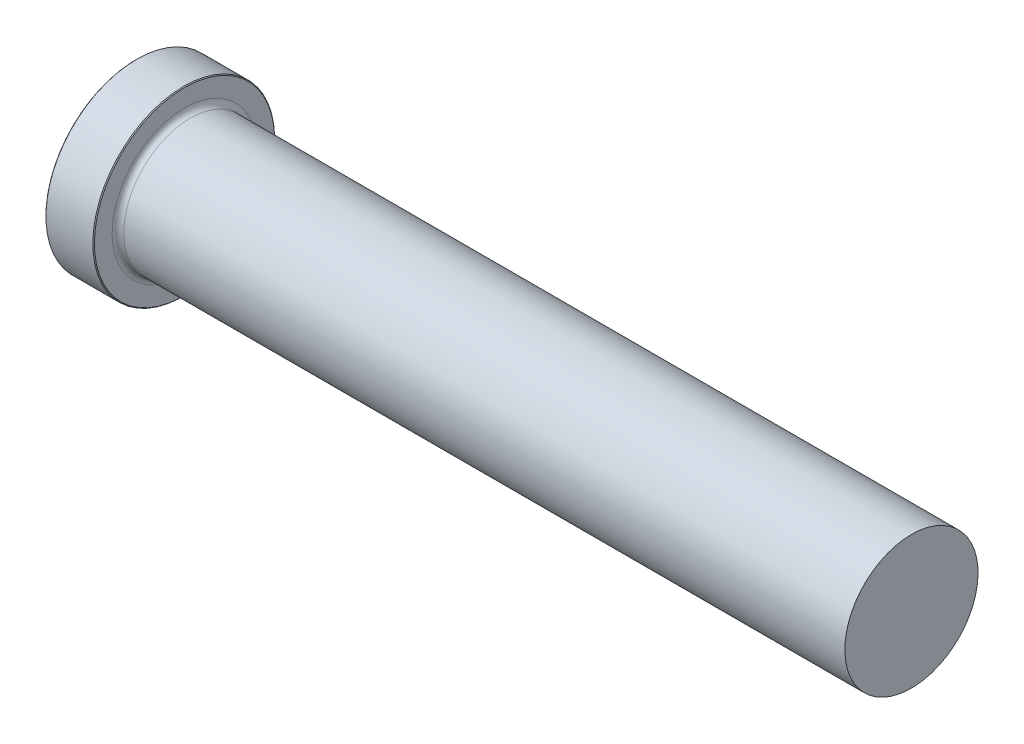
ISO-10303-21;
HEADER;
FILE_DESCRIPTION(('STEP AP214'),'2;1');
FILE_NAME('part.step','',(''),(''),'','','');
FILE_SCHEMA(('AUTOMOTIVE_DESIGN { 1 0 10303 214 1 1 1 1 }'));
ENDSEC;
DATA;
#1=APPLICATION_CONTEXT('core data for automotive mechanical design processes');
#2=APPLICATION_PROTOCOL_DEFINITION('international standard','automotive_design',2000,#1);
#3=PRODUCT_CONTEXT('',#1,'mechanical');
#4=PRODUCT('Part','Part','',(#3));
#5=PRODUCT_RELATED_PRODUCT_CATEGORY('part','',(#4));
#6=PRODUCT_DEFINITION_FORMATION('','',#4);
#7=PRODUCT_DEFINITION_CONTEXT('part definition',#1,'design');
#8=PRODUCT_DEFINITION('design','',#6,#7);
#9=PRODUCT_DEFINITION_SHAPE('','',#8);
#10=(LENGTH_UNIT() NAMED_UNIT(*) SI_UNIT(.MILLI.,.METRE.));
#11=(NAMED_UNIT(*) PLANE_ANGLE_UNIT() SI_UNIT($,.RADIAN.));
#12=(NAMED_UNIT(*) SI_UNIT($,.STERADIAN.) SOLID_ANGLE_UNIT());
#13=UNCERTAINTY_MEASURE_WITH_UNIT(LENGTH_MEASURE(1.E-05),#10,'distance_accuracy_value','');
#14=(GEOMETRIC_REPRESENTATION_CONTEXT(3) GLOBAL_UNCERTAINTY_ASSIGNED_CONTEXT((#13)) GLOBAL_UNIT_ASSIGNED_CONTEXT((#10,
#11,#12)) REPRESENTATION_CONTEXT('',''));
#15=CARTESIAN_POINT('',(0.,0.,0.));
#16=DIRECTION('',(0.,0.,1.));
#17=DIRECTION('',(1.,0.,0.));
#18=AXIS2_PLACEMENT_3D('',#15,#16,#17);
#19=CARTESIAN_POINT('',(101.6,8.7249,0.));
#20=DIRECTION('',(1.,0.,0.));
#21=DIRECTION('',(0.,1.,0.));
#22=AXIS2_PLACEMENT_3D('',#19,#20,#21);
#23=PLANE('',#22);
#24=CARTESIAN_POINT('',(101.6,0.,0.));
#25=DIRECTION('',(1.,0.,0.));
#26=DIRECTION('',(0.,1.,0.));
#27=AXIS2_PLACEMENT_3D('',#24,#25,#26);
#28=CIRCLE('',#27,8.7249);
#29=CARTESIAN_POINT('',(101.6,8.7249,0.));
#30=VERTEX_POINT('',#29);
#31=EDGE_CURVE('E50',#30,#30,#28,.T.);
#32=ORIENTED_EDGE('',*,*,#31,.T.);
#33=EDGE_LOOP('',(#32));
#34=FACE_BOUND('',#33,.T.);
#35=ADVANCED_FACE('F30',(#34),#23,.T.);
#36=CARTESIAN_POINT('',(101.6,0.,0.));
#37=DIRECTION('',(1.,0.,0.));
#38=DIRECTION('',(0.,1.,0.));
#39=AXIS2_PLACEMENT_3D('',#36,#37,#38);
#40=CYLINDRICAL_SURFACE('',#39,8.7249);
#41=CARTESIAN_POINT('',(7.11199999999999,0.,0.));
#42=DIRECTION('',(1.,0.,0.));
#43=DIRECTION('',(0.,1.,0.));
#44=AXIS2_PLACEMENT_3D('',#41,#42,#43);
#45=CIRCLE('',#44,8.7249);
#46=CARTESIAN_POINT('',(7.11199999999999,8.7249,0.));
#47=VERTEX_POINT('',#46);
#48=EDGE_CURVE('E53',#47,#47,#45,.T.);
#49=ORIENTED_EDGE('',*,*,#48,.T.);
#50=EDGE_LOOP('',(#49));
#51=FACE_BOUND('',#50,.T.);
#52=ORIENTED_EDGE('',*,*,#31,.F.);
#53=EDGE_LOOP('',(#52));
#54=FACE_BOUND('',#53,.T.);
#55=ADVANCED_FACE('F74',(#51,#54),#40,.T.);
#56=CARTESIAN_POINT('',(7.112,0.,0.));
#57=DIRECTION('',(1.,0.,0.));
#58=DIRECTION('',(0.,1.,0.));
#59=AXIS2_PLACEMENT_3D('',#56,#57,#58);
#60=TOROIDAL_SURFACE('',#59,9.4869,0.762000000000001);
#61=CARTESIAN_POINT('',(6.34999999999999,0.,0.));
#62=DIRECTION('',(1.,0.,0.));
#63=DIRECTION('',(0.,1.,0.));
#64=AXIS2_PLACEMENT_3D('',#61,#62,#63);
#65=CIRCLE('',#64,9.4869);
#66=CARTESIAN_POINT('',(6.35,9.4869,0.));
#67=VERTEX_POINT('',#66);
#68=EDGE_CURVE('E56',#67,#67,#65,.T.);
#69=ORIENTED_EDGE('',*,*,#68,.T.);
#70=EDGE_LOOP('',(#69));
#71=FACE_BOUND('',#70,.T.);
#72=ORIENTED_EDGE('',*,*,#48,.F.);
#73=EDGE_LOOP('',(#72));
#74=FACE_BOUND('',#73,.T.);
#75=ADVANCED_FACE('F60',(#71,#74),#60,.F.);
#76=CARTESIAN_POINT('',(6.35,11.90625,0.));
#77=DIRECTION('',(1.,0.,0.));
#78=DIRECTION('',(0.,1.,0.));
#79=AXIS2_PLACEMENT_3D('',#76,#77,#78);
#80=PLANE('',#79);
#81=CARTESIAN_POINT('',(6.35,0.,0.));
#82=DIRECTION('',(1.,0.,0.));
#83=DIRECTION('',(0.,1.,0.));
#84=AXIS2_PLACEMENT_3D('',#81,#82,#83);
#85=CIRCLE('',#84,11.80465);
#86=CARTESIAN_POINT('',(6.35,11.80465,0.));
#87=VERTEX_POINT('',#86);
#88=EDGE_CURVE('E10',#87,#87,#85,.T.);
#89=ORIENTED_EDGE('',*,*,#88,.T.);
#90=EDGE_LOOP('',(#89));
#91=FACE_BOUND('',#90,.T.);
#92=ORIENTED_EDGE('',*,*,#68,.F.);
#93=EDGE_LOOP('',(#92));
#94=FACE_BOUND('',#93,.T.);
#95=ADVANCED_FACE('F63',(#91,#94),#80,.T.);
#96=CARTESIAN_POINT('',(101.6,0.,0.));
#97=DIRECTION('',(1.,0.,0.));
#98=DIRECTION('',(0.,1.,0.));
#99=AXIS2_PLACEMENT_3D('',#96,#97,#98);
#100=CYLINDRICAL_SURFACE('',#99,11.90625);
#101=CARTESIAN_POINT('',(0.101600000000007,0.,0.));
#102=DIRECTION('',(-1.,0.,0.));
#103=DIRECTION('',(0.,-1.,0.));
#104=AXIS2_PLACEMENT_3D('',#101,#102,#103);
#105=CIRCLE('',#104,11.90625);
#106=CARTESIAN_POINT('',(0.101600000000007,-11.90625,0.));
#107=VERTEX_POINT('',#106);
#108=EDGE_CURVE('E41',#107,#107,#105,.F.);
#109=ORIENTED_EDGE('',*,*,#108,.T.);
#110=EDGE_LOOP('',(#109));
#111=FACE_BOUND('',#110,.T.);
#112=CARTESIAN_POINT('',(6.2484,0.,0.));
#113=DIRECTION('',(1.,0.,0.));
#114=DIRECTION('',(0.,1.,0.));
#115=AXIS2_PLACEMENT_3D('',#112,#113,#114);
#116=CIRCLE('',#115,11.90625);
#117=CARTESIAN_POINT('',(6.2484,11.90625,0.));
#118=VERTEX_POINT('',#117);
#119=EDGE_CURVE('E45',#118,#118,#116,.F.);
#120=ORIENTED_EDGE('',*,*,#119,.T.);
#121=EDGE_LOOP('',(#120));
#122=FACE_BOUND('',#121,.T.);
#123=ADVANCED_FACE('F65',(#111,#122),#100,.T.);
#124=CARTESIAN_POINT('',(0.,0.,0.));
#125=DIRECTION('',(-1.,0.,0.));
#126=DIRECTION('',(0.,-1.,0.));
#127=AXIS2_PLACEMENT_3D('',#124,#125,#126);
#128=PLANE('',#127);
#129=CARTESIAN_POINT('',(0.,0.,0.));
#130=DIRECTION('',(-1.,0.,0.));
#131=DIRECTION('',(0.,-1.,0.));
#132=AXIS2_PLACEMENT_3D('',#129,#130,#131);
#133=CIRCLE('',#132,11.80465);
#134=CARTESIAN_POINT('',(0.,-11.80465,0.));
#135=VERTEX_POINT('',#134);
#136=EDGE_CURVE('E37',#135,#135,#133,.T.);
#137=ORIENTED_EDGE('',*,*,#136,.T.);
#138=EDGE_LOOP('',(#137));
#139=FACE_BOUND('',#138,.T.);
#140=ADVANCED_FACE('F71',(#139),#128,.T.);
#141=CARTESIAN_POINT('',(0.101600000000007,0.,0.));
#142=DIRECTION('',(1.,0.,0.));
#143=DIRECTION('',(0.,1.,0.));
#144=AXIS2_PLACEMENT_3D('',#141,#142,#143);
#145=CONICAL_SURFACE('',#144,11.90625,0.785398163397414);
#146=ORIENTED_EDGE('',*,*,#136,.F.);
#147=EDGE_LOOP('',(#146));
#148=FACE_BOUND('',#147,.T.);
#149=ORIENTED_EDGE('',*,*,#108,.F.);
#150=EDGE_LOOP('',(#149));
#151=FACE_BOUND('',#150,.T.);
#152=ADVANCED_FACE('F84',(#148,#151),#145,.T.);
#153=CARTESIAN_POINT('',(6.34999999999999,0.,0.));
#154=DIRECTION('',(-1.,0.,0.));
#155=DIRECTION('',(0.,-1.,0.));
#156=AXIS2_PLACEMENT_3D('',#153,#154,#155);
#157=CONICAL_SURFACE('',#156,11.80465,0.785398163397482);
#158=ORIENTED_EDGE('',*,*,#119,.F.);
#159=EDGE_LOOP('',(#158));
#160=FACE_BOUND('',#159,.T.);
#161=ORIENTED_EDGE('',*,*,#88,.F.);
#162=EDGE_LOOP('',(#161));
#163=FACE_BOUND('',#162,.T.);
#164=ADVANCED_FACE('F32',(#160,#163),#157,.T.);
#165=CLOSED_SHELL('',(#35,#55,#75,#95,#123,#140,#152,#164));
#166=MANIFOLD_SOLID_BREP('B2',#165);
#167=ADVANCED_BREP_SHAPE_REPRESENTATION('',(#18,#166),#14);
#168=SHAPE_DEFINITION_REPRESENTATION(#9,#167);
ENDSEC;
END-ISO-10303-21;
